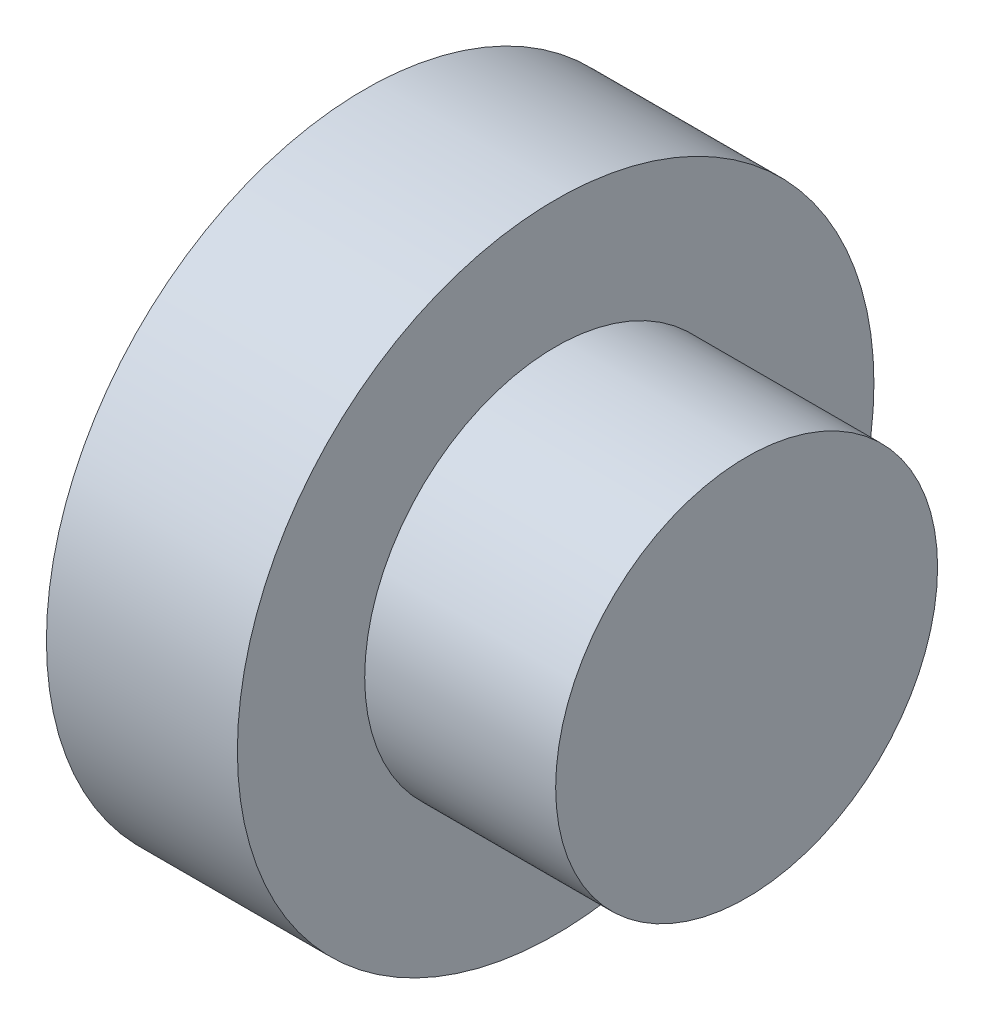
ISO-10303-21;
HEADER;
FILE_DESCRIPTION(('STEP AP214'),'2;1');
FILE_NAME('part.step','',(''),(''),'','','');
FILE_SCHEMA(('AUTOMOTIVE_DESIGN { 1 0 10303 214 1 1 1 1 }'));
ENDSEC;
DATA;
#1=APPLICATION_CONTEXT('core data for automotive mechanical design processes');
#2=APPLICATION_PROTOCOL_DEFINITION('international standard','automotive_design',2000,#1);
#3=PRODUCT_CONTEXT('',#1,'mechanical');
#4=PRODUCT('Part','Part','',(#3));
#5=PRODUCT_RELATED_PRODUCT_CATEGORY('part','',(#4));
#6=PRODUCT_DEFINITION_FORMATION('','',#4);
#7=PRODUCT_DEFINITION_CONTEXT('part definition',#1,'design');
#8=PRODUCT_DEFINITION('design','',#6,#7);
#9=PRODUCT_DEFINITION_SHAPE('','',#8);
#10=(LENGTH_UNIT() NAMED_UNIT(*) SI_UNIT(.MILLI.,.METRE.));
#11=(NAMED_UNIT(*) PLANE_ANGLE_UNIT() SI_UNIT($,.RADIAN.));
#12=(NAMED_UNIT(*) SI_UNIT($,.STERADIAN.) SOLID_ANGLE_UNIT());
#13=UNCERTAINTY_MEASURE_WITH_UNIT(LENGTH_MEASURE(1.E-05),#10,'distance_accuracy_value','');
#14=(GEOMETRIC_REPRESENTATION_CONTEXT(3) GLOBAL_UNCERTAINTY_ASSIGNED_CONTEXT((#13)) GLOBAL_UNIT_ASSIGNED_CONTEXT((#10,
#11,#12)) REPRESENTATION_CONTEXT('',''));
#15=CARTESIAN_POINT('',(0.,0.,0.));
#16=DIRECTION('',(0.,0.,1.));
#17=DIRECTION('',(1.,0.,0.));
#18=AXIS2_PLACEMENT_3D('',#15,#16,#17);
#19=CARTESIAN_POINT('',(0.,0.,-5.));
#20=DIRECTION('',(1.,0.,0.));
#21=DIRECTION('',(0.,0.,-1.));
#22=AXIS2_PLACEMENT_3D('',#19,#20,#21);
#23=PLANE('',#22);
#24=CARTESIAN_POINT('',(0.,0.,0.));
#25=DIRECTION('',(-1.,0.,0.));
#26=DIRECTION('',(0.,0.,1.));
#27=AXIS2_PLACEMENT_3D('',#24,#25,#26);
#28=CIRCLE('',#27,5.);
#29=CARTESIAN_POINT('',(0.,0.,5.));
#30=VERTEX_POINT('',#29);
#31=EDGE_CURVE('E42',#30,#30,#28,.T.);
#32=ORIENTED_EDGE('',*,*,#31,.T.);
#33=EDGE_LOOP('',(#32));
#34=FACE_BOUND('',#33,.T.);
#35=ADVANCED_FACE('F28',(#34),#23,.F.);
#36=CARTESIAN_POINT('',(5.99999999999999,0.,0.));
#37=DIRECTION('',(-1.,0.,0.));
#38=DIRECTION('',(0.,0.,1.));
#39=AXIS2_PLACEMENT_3D('',#36,#37,#38);
#40=PLANE('',#39);
#41=CARTESIAN_POINT('',(5.99999999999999,0.,0.));
#42=DIRECTION('',(-1.,0.,0.));
#43=DIRECTION('',(0.,0.,1.));
#44=AXIS2_PLACEMENT_3D('',#41,#42,#43);
#45=CIRCLE('',#44,3.);
#46=CARTESIAN_POINT('',(5.99999999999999,0.,3.));
#47=VERTEX_POINT('',#46);
#48=EDGE_CURVE('E10',#47,#47,#45,.T.);
#49=ORIENTED_EDGE('',*,*,#48,.F.);
#50=EDGE_LOOP('',(#49));
#51=FACE_BOUND('',#50,.T.);
#52=ADVANCED_FACE('F62',(#51),#40,.F.);
#53=CARTESIAN_POINT('',(0.,0.,0.));
#54=DIRECTION('',(-1.,0.,0.));
#55=DIRECTION('',(0.,0.,1.));
#56=AXIS2_PLACEMENT_3D('',#53,#54,#55);
#57=CYLINDRICAL_SURFACE('',#56,3.);
#58=CARTESIAN_POINT('',(3.,0.,0.));
#59=DIRECTION('',(-1.,0.,0.));
#60=DIRECTION('',(0.,0.,1.));
#61=AXIS2_PLACEMENT_3D('',#58,#59,#60);
#62=CIRCLE('',#61,3.);
#63=CARTESIAN_POINT('',(3.,0.,3.));
#64=VERTEX_POINT('',#63);
#65=EDGE_CURVE('E34',#64,#64,#62,.T.);
#66=ORIENTED_EDGE('',*,*,#65,.F.);
#67=EDGE_LOOP('',(#66));
#68=FACE_BOUND('',#67,.T.);
#69=ORIENTED_EDGE('',*,*,#48,.T.);
#70=EDGE_LOOP('',(#69));
#71=FACE_BOUND('',#70,.T.);
#72=ADVANCED_FACE('F57',(#68,#71),#57,.T.);
#73=CARTESIAN_POINT('',(3.,0.,-3.));
#74=DIRECTION('',(-1.,0.,0.));
#75=DIRECTION('',(0.,0.,1.));
#76=AXIS2_PLACEMENT_3D('',#73,#74,#75);
#77=PLANE('',#76);
#78=CARTESIAN_POINT('',(3.,0.,0.));
#79=DIRECTION('',(-1.,0.,0.));
#80=DIRECTION('',(0.,0.,1.));
#81=AXIS2_PLACEMENT_3D('',#78,#79,#80);
#82=CIRCLE('',#81,5.);
#83=CARTESIAN_POINT('',(3.,0.,5.));
#84=VERTEX_POINT('',#83);
#85=EDGE_CURVE('E38',#84,#84,#82,.T.);
#86=ORIENTED_EDGE('',*,*,#85,.F.);
#87=EDGE_LOOP('',(#86));
#88=FACE_BOUND('',#87,.T.);
#89=ORIENTED_EDGE('',*,*,#65,.T.);
#90=EDGE_LOOP('',(#89));
#91=FACE_BOUND('',#90,.T.);
#92=ADVANCED_FACE('F52',(#88,#91),#77,.F.);
#93=CARTESIAN_POINT('',(0.,0.,0.));
#94=DIRECTION('',(-1.,0.,0.));
#95=DIRECTION('',(0.,0.,1.));
#96=AXIS2_PLACEMENT_3D('',#93,#94,#95);
#97=CYLINDRICAL_SURFACE('',#96,5.);
#98=ORIENTED_EDGE('',*,*,#31,.F.);
#99=EDGE_LOOP('',(#98));
#100=FACE_BOUND('',#99,.T.);
#101=ORIENTED_EDGE('',*,*,#85,.T.);
#102=EDGE_LOOP('',(#101));
#103=FACE_BOUND('',#102,.T.);
#104=ADVANCED_FACE('F49',(#100,#103),#97,.T.);
#105=CLOSED_SHELL('',(#35,#52,#72,#92,#104));
#106=MANIFOLD_SOLID_BREP('B2',#105);
#107=ADVANCED_BREP_SHAPE_REPRESENTATION('',(#18,#106),#14);
#108=SHAPE_DEFINITION_REPRESENTATION(#9,#107);
ENDSEC;
END-ISO-10303-21;
